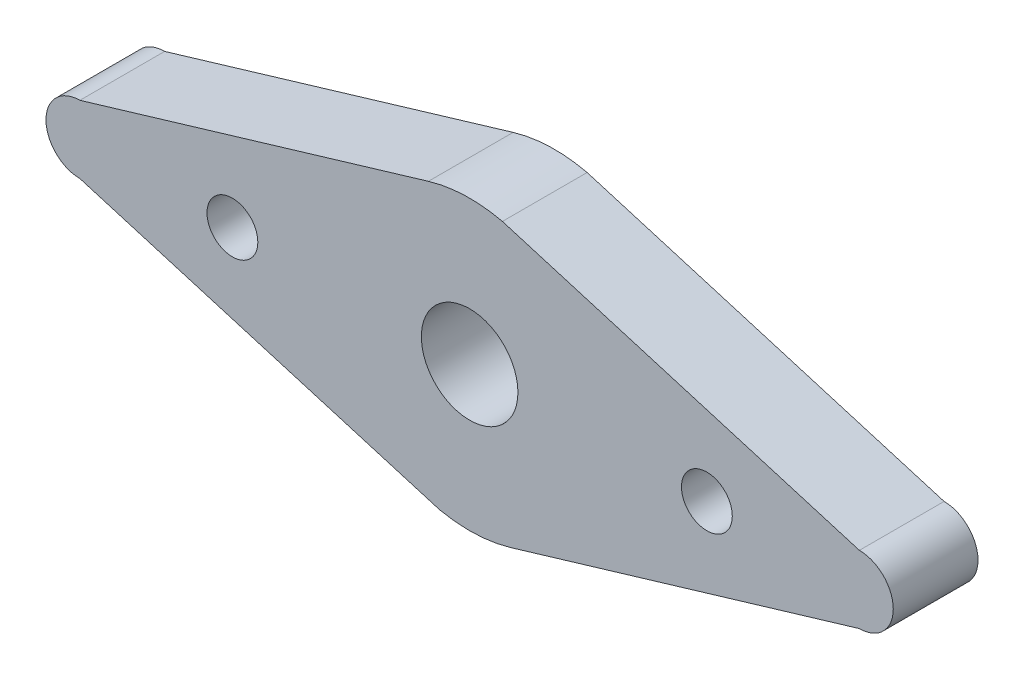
ISO-10303-21;
HEADER;
FILE_DESCRIPTION(('STEP AP214'),'2;1');
FILE_NAME('part.step','',(''),(''),'','','');
FILE_SCHEMA(('AUTOMOTIVE_DESIGN { 1 0 10303 214 1 1 1 1 }'));
ENDSEC;
DATA;
#1=APPLICATION_CONTEXT('core data for automotive mechanical design processes');
#2=APPLICATION_PROTOCOL_DEFINITION('international standard','automotive_design',2000,#1);
#3=PRODUCT_CONTEXT('',#1,'mechanical');
#4=PRODUCT('Part','Part','',(#3));
#5=PRODUCT_RELATED_PRODUCT_CATEGORY('part','',(#4));
#6=PRODUCT_DEFINITION_FORMATION('','',#4);
#7=PRODUCT_DEFINITION_CONTEXT('part definition',#1,'design');
#8=PRODUCT_DEFINITION('design','',#6,#7);
#9=PRODUCT_DEFINITION_SHAPE('','',#8);
#10=(LENGTH_UNIT() NAMED_UNIT(*) SI_UNIT(.MILLI.,.METRE.));
#11=(NAMED_UNIT(*) PLANE_ANGLE_UNIT() SI_UNIT($,.RADIAN.));
#12=(NAMED_UNIT(*) SI_UNIT($,.STERADIAN.) SOLID_ANGLE_UNIT());
#13=UNCERTAINTY_MEASURE_WITH_UNIT(LENGTH_MEASURE(1.E-05),#10,'distance_accuracy_value','');
#14=(GEOMETRIC_REPRESENTATION_CONTEXT(3) GLOBAL_UNCERTAINTY_ASSIGNED_CONTEXT((#13)) GLOBAL_UNIT_ASSIGNED_CONTEXT((#10,
#11,#12)) REPRESENTATION_CONTEXT('',''));
#15=CARTESIAN_POINT('',(0.,0.,0.));
#16=DIRECTION('',(0.,0.,1.));
#17=DIRECTION('',(1.,0.,0.));
#18=AXIS2_PLACEMENT_3D('',#15,#16,#17);
#19=CARTESIAN_POINT('',(-2.4149265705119,-8.1212026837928,5.));
#20=DIRECTION('',(0.28502611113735,0.958519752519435,0.));
#21=DIRECTION('',(-0.958519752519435,0.28502611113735,0.));
#22=AXIS2_PLACEMENT_3D('',#19,#20,#21);
#23=PLANE('',#22);
#24=DIRECTION('',(0.958519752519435,-0.28502611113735,0.));
#25=VECTOR('',#24,1.);
#26=CARTESIAN_POINT('',(-2.4149265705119,-8.1212026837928,0.));
#27=LINE('',#26,#25);
#28=CARTESIAN_POINT('',(-23.0000029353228,-2.00000982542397,0.));
#29=VERTEX_POINT('',#28);
#30=CARTESIAN_POINT('',(-1.76186811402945,-8.31539660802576,0.));
#31=VERTEX_POINT('',#30);
#32=EDGE_CURVE('E139',#29,#31,#27,.T.);
#33=ORIENTED_EDGE('',*,*,#32,.T.);
#34=DIRECTION('',(0.,0.,-1.));
#35=VECTOR('',#34,1.);
#36=CARTESIAN_POINT('',(-1.76186811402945,-8.31539660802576,5.));
#37=LINE('',#36,#35);
#38=CARTESIAN_POINT('',(-1.76186811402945,-8.31539660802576,5.));
#39=VERTEX_POINT('',#38);
#40=EDGE_CURVE('E11',#39,#31,#37,.T.);
#41=ORIENTED_EDGE('',*,*,#40,.F.);
#42=DIRECTION('',(0.958519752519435,-0.28502611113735,0.));
#43=VECTOR('',#42,1.);
#44=CARTESIAN_POINT('',(-2.4149265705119,-8.1212026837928,5.));
#45=LINE('',#44,#43);
#46=CARTESIAN_POINT('',(-23.0000029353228,-2.00000982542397,5.));
#47=VERTEX_POINT('',#46);
#48=EDGE_CURVE('E188',#47,#39,#45,.T.);
#49=ORIENTED_EDGE('',*,*,#48,.F.);
#50=DIRECTION('',(0.,0.,-1.));
#51=VECTOR('',#50,1.);
#52=CARTESIAN_POINT('',(-23.0000029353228,-2.00000982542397,5.));
#53=LINE('',#52,#51);
#54=EDGE_CURVE('E126',#47,#29,#53,.T.);
#55=ORIENTED_EDGE('',*,*,#54,.T.);
#56=EDGE_LOOP('',(#33,#41,#49,#55));
#57=FACE_BOUND('',#56,.T.);
#58=ADVANCED_FACE('F34',(#57),#23,.F.);
#59=CARTESIAN_POINT('',(0.,0.,5.));
#60=DIRECTION('',(0.,0.,-1.));
#61=DIRECTION('',(-1.,0.,0.));
#62=AXIS2_PLACEMENT_3D('',#59,#60,#61);
#63=CYLINDRICAL_SURFACE('',#62,8.5);
#64=CARTESIAN_POINT('',(0.,0.,0.));
#65=DIRECTION('',(0.,0.,1.));
#66=DIRECTION('',(1.,0.,0.));
#67=AXIS2_PLACEMENT_3D('',#64,#65,#66);
#68=CIRCLE('',#67,8.5);
#69=CARTESIAN_POINT('',(2.43309837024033,-8.14432516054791,0.));
#70=VERTEX_POINT('',#69);
#71=EDGE_CURVE('E142',#31,#70,#68,.T.);
#72=ORIENTED_EDGE('',*,*,#71,.T.);
#73=DIRECTION('',(0.,0.,-1.));
#74=VECTOR('',#73,1.);
#75=CARTESIAN_POINT('',(2.43309837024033,-8.14432516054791,5.));
#76=LINE('',#75,#74);
#77=CARTESIAN_POINT('',(2.43309837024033,-8.14432516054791,5.));
#78=VERTEX_POINT('',#77);
#79=EDGE_CURVE('E43',#78,#70,#76,.T.);
#80=ORIENTED_EDGE('',*,*,#79,.F.);
#81=CARTESIAN_POINT('',(0.,0.,5.));
#82=DIRECTION('',(0.,0.,1.));
#83=DIRECTION('',(1.,0.,0.));
#84=AXIS2_PLACEMENT_3D('',#81,#82,#83);
#85=CIRCLE('',#84,8.5);
#86=EDGE_CURVE('E90',#39,#78,#85,.T.);
#87=ORIENTED_EDGE('',*,*,#86,.F.);
#88=ORIENTED_EDGE('',*,*,#40,.T.);
#89=EDGE_LOOP('',(#72,#80,#87,#88));
#90=FACE_BOUND('',#89,.T.);
#91=ADVANCED_FACE('F170',(#90),#63,.T.);
#92=CARTESIAN_POINT('',(2.43309837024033,-8.14432516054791,5.));
#93=DIRECTION('',(0.286246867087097,-0.958155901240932,0.));
#94=DIRECTION('',(0.958155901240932,0.286246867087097,0.));
#95=AXIS2_PLACEMENT_3D('',#92,#93,#94);
#96=PLANE('',#95);
#97=DIRECTION('',(-0.958155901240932,-0.286246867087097,0.));
#98=VECTOR('',#97,1.);
#99=CARTESIAN_POINT('',(2.43309837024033,-8.14432516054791,0.));
#100=LINE('',#99,#98);
#101=CARTESIAN_POINT('',(23.0000029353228,-2.00000982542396,0.));
#102=VERTEX_POINT('',#101);
#103=EDGE_CURVE('E145',#102,#70,#100,.T.);
#104=ORIENTED_EDGE('',*,*,#103,.F.);
#105=DIRECTION('',(0.,0.,-1.));
#106=VECTOR('',#105,1.);
#107=CARTESIAN_POINT('',(23.0000029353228,-2.00000982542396,5.));
#108=LINE('',#107,#106);
#109=CARTESIAN_POINT('',(23.0000029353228,-2.00000982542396,5.));
#110=VERTEX_POINT('',#109);
#111=EDGE_CURVE('E163',#110,#102,#108,.T.);
#112=ORIENTED_EDGE('',*,*,#111,.F.);
#113=DIRECTION('',(-0.958155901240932,-0.286246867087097,0.));
#114=VECTOR('',#113,1.);
#115=CARTESIAN_POINT('',(2.43309837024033,-8.14432516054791,5.));
#116=LINE('',#115,#114);
#117=EDGE_CURVE('E169',#110,#78,#116,.T.);
#118=ORIENTED_EDGE('',*,*,#117,.T.);
#119=ORIENTED_EDGE('',*,*,#79,.T.);
#120=EDGE_LOOP('',(#104,#112,#118,#119));
#121=FACE_BOUND('',#120,.T.);
#122=ADVANCED_FACE('F167',(#121),#96,.T.);
#123=CARTESIAN_POINT('',(23.0000029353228,0.,5.));
#124=DIRECTION('',(0.,0.,-1.));
#125=DIRECTION('',(-1.,0.,0.));
#126=AXIS2_PLACEMENT_3D('',#123,#124,#125);
#127=CYLINDRICAL_SURFACE('',#126,2.00000982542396);
#128=CARTESIAN_POINT('',(23.0000029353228,0.,0.));
#129=DIRECTION('',(0.,0.,1.));
#130=DIRECTION('',(1.,0.,0.));
#131=AXIS2_PLACEMENT_3D('',#128,#129,#130);
#132=CIRCLE('',#131,2.00000982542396);
#133=CARTESIAN_POINT('',(23.0000029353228,2.00000982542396,0.));
#134=VERTEX_POINT('',#133);
#135=EDGE_CURVE('E148',#102,#134,#132,.T.);
#136=ORIENTED_EDGE('',*,*,#135,.T.);
#137=DIRECTION('',(0.,0.,-1.));
#138=VECTOR('',#137,1.);
#139=CARTESIAN_POINT('',(23.0000029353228,2.00000982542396,5.));
#140=LINE('',#139,#138);
#141=CARTESIAN_POINT('',(23.0000029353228,2.00000982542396,5.));
#142=VERTEX_POINT('',#141);
#143=EDGE_CURVE('E160',#142,#134,#140,.T.);
#144=ORIENTED_EDGE('',*,*,#143,.F.);
#145=CARTESIAN_POINT('',(23.0000029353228,0.,5.));
#146=DIRECTION('',(0.,0.,1.));
#147=DIRECTION('',(1.,0.,0.));
#148=AXIS2_PLACEMENT_3D('',#145,#146,#147);
#149=CIRCLE('',#148,2.00000982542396);
#150=EDGE_CURVE('E183',#110,#142,#149,.T.);
#151=ORIENTED_EDGE('',*,*,#150,.F.);
#152=ORIENTED_EDGE('',*,*,#111,.T.);
#153=EDGE_LOOP('',(#136,#144,#151,#152));
#154=FACE_BOUND('',#153,.T.);
#155=ADVANCED_FACE('F179',(#154),#127,.T.);
#156=CARTESIAN_POINT('',(2.42287873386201,8.13133623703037,5.));
#157=DIRECTION('',(-0.285560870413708,-0.958360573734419,0.));
#158=DIRECTION('',(0.958360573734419,-0.285560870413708,0.));
#159=AXIS2_PLACEMENT_3D('',#156,#157,#158);
#160=PLANE('',#159);
#161=DIRECTION('',(-0.958360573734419,0.285560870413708,0.));
#162=VECTOR('',#161,1.);
#163=CARTESIAN_POINT('',(2.42287873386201,8.13133623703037,0.));
#164=LINE('',#163,#162);
#165=CARTESIAN_POINT('',(1.93324215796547,8.27723231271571,0.));
#166=VERTEX_POINT('',#165);
#167=EDGE_CURVE('E150',#134,#166,#164,.T.);
#168=ORIENTED_EDGE('',*,*,#167,.T.);
#169=DIRECTION('',(0.,0.,-1.));
#170=VECTOR('',#169,1.);
#171=CARTESIAN_POINT('',(1.93324215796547,8.27723231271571,5.));
#172=LINE('',#171,#170);
#173=CARTESIAN_POINT('',(1.93324215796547,8.27723231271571,5.));
#174=VERTEX_POINT('',#173);
#175=EDGE_CURVE('E122',#174,#166,#172,.T.);
#176=ORIENTED_EDGE('',*,*,#175,.F.);
#177=DIRECTION('',(-0.958360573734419,0.285560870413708,0.));
#178=VECTOR('',#177,1.);
#179=CARTESIAN_POINT('',(2.42287873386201,8.13133623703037,5.));
#180=LINE('',#179,#178);
#181=EDGE_CURVE('E109',#142,#174,#180,.T.);
#182=ORIENTED_EDGE('',*,*,#181,.F.);
#183=ORIENTED_EDGE('',*,*,#143,.T.);
#184=EDGE_LOOP('',(#168,#176,#182,#183));
#185=FACE_BOUND('',#184,.T.);
#186=ADVANCED_FACE('F182',(#185),#160,.F.);
#187=CARTESIAN_POINT('',(0.,0.,5.));
#188=DIRECTION('',(0.,0.,-1.));
#189=DIRECTION('',(-1.,0.,0.));
#190=AXIS2_PLACEMENT_3D('',#187,#188,#189);
#191=CYLINDRICAL_SURFACE('',#190,8.5);
#192=CARTESIAN_POINT('',(0.,0.,0.));
#193=DIRECTION('',(0.,0.,1.));
#194=DIRECTION('',(1.,0.,0.));
#195=AXIS2_PLACEMENT_3D('',#192,#193,#194);
#196=CIRCLE('',#195,8.5);
#197=CARTESIAN_POINT('',(-2.43309837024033,8.14432516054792,0.));
#198=VERTEX_POINT('',#197);
#199=EDGE_CURVE('E118',#166,#198,#196,.T.);
#200=ORIENTED_EDGE('',*,*,#199,.T.);
#201=DIRECTION('',(0.,0.,-1.));
#202=VECTOR('',#201,1.);
#203=CARTESIAN_POINT('',(-2.43309837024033,8.14432516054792,5.));
#204=LINE('',#203,#202);
#205=CARTESIAN_POINT('',(-2.43309837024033,8.14432516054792,5.));
#206=VERTEX_POINT('',#205);
#207=EDGE_CURVE('E115',#206,#198,#204,.T.);
#208=ORIENTED_EDGE('',*,*,#207,.F.);
#209=CARTESIAN_POINT('',(0.,0.,5.));
#210=DIRECTION('',(0.,0.,1.));
#211=DIRECTION('',(1.,0.,0.));
#212=AXIS2_PLACEMENT_3D('',#209,#210,#211);
#213=CIRCLE('',#212,8.5);
#214=EDGE_CURVE('E103',#174,#206,#213,.T.);
#215=ORIENTED_EDGE('',*,*,#214,.F.);
#216=ORIENTED_EDGE('',*,*,#175,.T.);
#217=EDGE_LOOP('',(#200,#208,#215,#216));
#218=FACE_BOUND('',#217,.T.);
#219=ADVANCED_FACE('F116',(#218),#191,.T.);
#220=CARTESIAN_POINT('',(-2.43309837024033,8.14432516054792,5.));
#221=DIRECTION('',(-0.286246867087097,0.958155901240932,0.));
#222=DIRECTION('',(-0.958155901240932,-0.286246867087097,0.));
#223=AXIS2_PLACEMENT_3D('',#220,#221,#222);
#224=PLANE('',#223);
#225=DIRECTION('',(0.958155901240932,0.286246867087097,0.));
#226=VECTOR('',#225,1.);
#227=CARTESIAN_POINT('',(-2.43309837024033,8.14432516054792,0.));
#228=LINE('',#227,#226);
#229=CARTESIAN_POINT('',(-23.0000029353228,2.00000982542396,0.));
#230=VERTEX_POINT('',#229);
#231=EDGE_CURVE('E153',#230,#198,#228,.T.);
#232=ORIENTED_EDGE('',*,*,#231,.F.);
#233=DIRECTION('',(0.,0.,-1.));
#234=VECTOR('',#233,1.);
#235=CARTESIAN_POINT('',(-23.0000029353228,2.00000982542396,5.));
#236=LINE('',#235,#234);
#237=CARTESIAN_POINT('',(-23.0000029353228,2.00000982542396,5.));
#238=VERTEX_POINT('',#237);
#239=EDGE_CURVE('E79',#238,#230,#236,.T.);
#240=ORIENTED_EDGE('',*,*,#239,.F.);
#241=DIRECTION('',(0.958155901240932,0.286246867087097,0.));
#242=VECTOR('',#241,1.);
#243=CARTESIAN_POINT('',(-2.43309837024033,8.14432516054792,5.));
#244=LINE('',#243,#242);
#245=EDGE_CURVE('E107',#238,#206,#244,.T.);
#246=ORIENTED_EDGE('',*,*,#245,.T.);
#247=ORIENTED_EDGE('',*,*,#207,.T.);
#248=EDGE_LOOP('',(#232,#240,#246,#247));
#249=FACE_BOUND('',#248,.T.);
#250=ADVANCED_FACE('F124',(#249),#224,.T.);
#251=CARTESIAN_POINT('',(0.,0.,5.));
#252=DIRECTION('',(0.,0.,-1.));
#253=DIRECTION('',(-1.,0.,0.));
#254=AXIS2_PLACEMENT_3D('',#251,#252,#253);
#255=CYLINDRICAL_SURFACE('',#254,2.85);
#256=CARTESIAN_POINT('',(0.,0.,5.));
#257=DIRECTION('',(0.,0.,1.));
#258=DIRECTION('',(1.,0.,0.));
#259=AXIS2_PLACEMENT_3D('',#256,#257,#258);
#260=CIRCLE('',#259,2.85);
#261=CARTESIAN_POINT('',(2.85,0.,5.));
#262=VERTEX_POINT('',#261);
#263=EDGE_CURVE('E190',#262,#262,#260,.T.);
#264=ORIENTED_EDGE('',*,*,#263,.T.);
#265=EDGE_LOOP('',(#264));
#266=FACE_BOUND('',#265,.T.);
#267=CARTESIAN_POINT('',(0.,0.,0.));
#268=DIRECTION('',(0.,0.,1.));
#269=DIRECTION('',(1.,0.,0.));
#270=AXIS2_PLACEMENT_3D('',#267,#268,#269);
#271=CIRCLE('',#270,2.85);
#272=CARTESIAN_POINT('',(2.85,0.,0.));
#273=VERTEX_POINT('',#272);
#274=EDGE_CURVE('E136',#273,#273,#271,.T.);
#275=ORIENTED_EDGE('',*,*,#274,.F.);
#276=EDGE_LOOP('',(#275));
#277=FACE_BOUND('',#276,.T.);
#278=ADVANCED_FACE('F209',(#266,#277),#255,.F.);
#279=CARTESIAN_POINT('',(-14.0000029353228,0.,5.));
#280=DIRECTION('',(0.,0.,-1.));
#281=DIRECTION('',(-1.,0.,0.));
#282=AXIS2_PLACEMENT_3D('',#279,#280,#281);
#283=CYLINDRICAL_SURFACE('',#282,1.5);
#284=CARTESIAN_POINT('',(-14.0000029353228,0.,5.));
#285=DIRECTION('',(0.,0.,1.));
#286=DIRECTION('',(1.,0.,0.));
#287=AXIS2_PLACEMENT_3D('',#284,#285,#286);
#288=CIRCLE('',#287,1.5);
#289=CARTESIAN_POINT('',(-12.5000029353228,0.,5.));
#290=VERTEX_POINT('',#289);
#291=EDGE_CURVE('E193',#290,#290,#288,.T.);
#292=ORIENTED_EDGE('',*,*,#291,.T.);
#293=EDGE_LOOP('',(#292));
#294=FACE_BOUND('',#293,.T.);
#295=CARTESIAN_POINT('',(-14.0000029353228,0.,0.));
#296=DIRECTION('',(0.,0.,1.));
#297=DIRECTION('',(1.,0.,0.));
#298=AXIS2_PLACEMENT_3D('',#295,#296,#297);
#299=CIRCLE('',#298,1.5);
#300=CARTESIAN_POINT('',(-12.5000029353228,0.,0.));
#301=VERTEX_POINT('',#300);
#302=EDGE_CURVE('E133',#301,#301,#299,.T.);
#303=ORIENTED_EDGE('',*,*,#302,.F.);
#304=EDGE_LOOP('',(#303));
#305=FACE_BOUND('',#304,.T.);
#306=ADVANCED_FACE('F212',(#294,#305),#283,.F.);
#307=CARTESIAN_POINT('',(14.0000029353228,0.,5.));
#308=DIRECTION('',(0.,0.,-1.));
#309=DIRECTION('',(-1.,0.,0.));
#310=AXIS2_PLACEMENT_3D('',#307,#308,#309);
#311=CYLINDRICAL_SURFACE('',#310,1.5);
#312=CARTESIAN_POINT('',(14.0000029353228,0.,5.));
#313=DIRECTION('',(0.,0.,1.));
#314=DIRECTION('',(1.,0.,0.));
#315=AXIS2_PLACEMENT_3D('',#312,#313,#314);
#316=CIRCLE('',#315,1.5);
#317=CARTESIAN_POINT('',(15.5000029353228,0.,5.));
#318=VERTEX_POINT('',#317);
#319=EDGE_CURVE('E156',#318,#318,#316,.T.);
#320=ORIENTED_EDGE('',*,*,#319,.T.);
#321=EDGE_LOOP('',(#320));
#322=FACE_BOUND('',#321,.T.);
#323=CARTESIAN_POINT('',(14.0000029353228,0.,0.));
#324=DIRECTION('',(0.,0.,1.));
#325=DIRECTION('',(1.,0.,0.));
#326=AXIS2_PLACEMENT_3D('',#323,#324,#325);
#327=CIRCLE('',#326,1.5);
#328=CARTESIAN_POINT('',(15.5000029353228,0.,0.));
#329=VERTEX_POINT('',#328);
#330=EDGE_CURVE('E130',#329,#329,#327,.T.);
#331=ORIENTED_EDGE('',*,*,#330,.F.);
#332=EDGE_LOOP('',(#331));
#333=FACE_BOUND('',#332,.T.);
#334=ADVANCED_FACE('F36',(#322,#333),#311,.F.);
#335=CARTESIAN_POINT('',(-23.0000029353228,0.,5.));
#336=DIRECTION('',(0.,0.,-1.));
#337=DIRECTION('',(-1.,0.,0.));
#338=AXIS2_PLACEMENT_3D('',#335,#336,#337);
#339=CYLINDRICAL_SURFACE('',#338,2.00000982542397);
#340=CARTESIAN_POINT('',(-23.0000029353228,0.,0.));
#341=DIRECTION('',(0.,0.,1.));
#342=DIRECTION('',(1.,0.,0.));
#343=AXIS2_PLACEMENT_3D('',#340,#341,#342);
#344=CIRCLE('',#343,2.00000982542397);
#345=EDGE_CURVE('E82',#230,#29,#344,.T.);
#346=ORIENTED_EDGE('',*,*,#345,.T.);
#347=ORIENTED_EDGE('',*,*,#54,.F.);
#348=CARTESIAN_POINT('',(-23.0000029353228,0.,5.));
#349=DIRECTION('',(0.,0.,1.));
#350=DIRECTION('',(1.,0.,0.));
#351=AXIS2_PLACEMENT_3D('',#348,#349,#350);
#352=CIRCLE('',#351,2.00000982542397);
#353=EDGE_CURVE('E51',#238,#47,#352,.T.);
#354=ORIENTED_EDGE('',*,*,#353,.F.);
#355=ORIENTED_EDGE('',*,*,#239,.T.);
#356=EDGE_LOOP('',(#346,#347,#354,#355));
#357=FACE_BOUND('',#356,.T.);
#358=ADVANCED_FACE('F203',(#357),#339,.T.);
#359=CARTESIAN_POINT('',(0.,0.,5.));
#360=DIRECTION('',(0.,0.,1.));
#361=DIRECTION('',(1.,0.,0.));
#362=AXIS2_PLACEMENT_3D('',#359,#360,#361);
#363=PLANE('',#362);
#364=ORIENTED_EDGE('',*,*,#319,.F.);
#365=EDGE_LOOP('',(#364));
#366=FACE_BOUND('',#365,.T.);
#367=ORIENTED_EDGE('',*,*,#291,.F.);
#368=EDGE_LOOP('',(#367));
#369=FACE_BOUND('',#368,.T.);
#370=ORIENTED_EDGE('',*,*,#263,.F.);
#371=EDGE_LOOP('',(#370));
#372=FACE_BOUND('',#371,.T.);
#373=ORIENTED_EDGE('',*,*,#48,.T.);
#374=ORIENTED_EDGE('',*,*,#86,.T.);
#375=ORIENTED_EDGE('',*,*,#117,.F.);
#376=ORIENTED_EDGE('',*,*,#150,.T.);
#377=ORIENTED_EDGE('',*,*,#181,.T.);
#378=ORIENTED_EDGE('',*,*,#214,.T.);
#379=ORIENTED_EDGE('',*,*,#245,.F.);
#380=ORIENTED_EDGE('',*,*,#353,.T.);
#381=EDGE_LOOP('',(#373,#374,#375,#376,#377,#378,#379,#380));
#382=FACE_BOUND('',#381,.T.);
#383=ADVANCED_FACE('F105',(#366,#369,#372,#382),#363,.T.);
#384=CARTESIAN_POINT('',(0.,0.,0.));
#385=DIRECTION('',(0.,0.,1.));
#386=DIRECTION('',(1.,0.,0.));
#387=AXIS2_PLACEMENT_3D('',#384,#385,#386);
#388=PLANE('',#387);
#389=ORIENTED_EDGE('',*,*,#330,.T.);
#390=EDGE_LOOP('',(#389));
#391=FACE_BOUND('',#390,.T.);
#392=ORIENTED_EDGE('',*,*,#302,.T.);
#393=EDGE_LOOP('',(#392));
#394=FACE_BOUND('',#393,.T.);
#395=ORIENTED_EDGE('',*,*,#274,.T.);
#396=EDGE_LOOP('',(#395));
#397=FACE_BOUND('',#396,.T.);
#398=ORIENTED_EDGE('',*,*,#32,.F.);
#399=ORIENTED_EDGE('',*,*,#345,.F.);
#400=ORIENTED_EDGE('',*,*,#231,.T.);
#401=ORIENTED_EDGE('',*,*,#199,.F.);
#402=ORIENTED_EDGE('',*,*,#167,.F.);
#403=ORIENTED_EDGE('',*,*,#135,.F.);
#404=ORIENTED_EDGE('',*,*,#103,.T.);
#405=ORIENTED_EDGE('',*,*,#71,.F.);
#406=EDGE_LOOP('',(#398,#399,#400,#401,#402,#403,#404,#405));
#407=FACE_BOUND('',#406,.T.);
#408=ADVANCED_FACE('F175',(#391,#394,#397,#407),#388,.F.);
#409=CLOSED_SHELL('',(#58,#91,#122,#155,#186,#219,#250,#278,#306,#334,#358,#383,#408));
#410=MANIFOLD_SOLID_BREP('B2',#409);
#411=ADVANCED_BREP_SHAPE_REPRESENTATION('',(#18,#410),#14);
#412=SHAPE_DEFINITION_REPRESENTATION(#9,#411);
ENDSEC;
END-ISO-10303-21;
